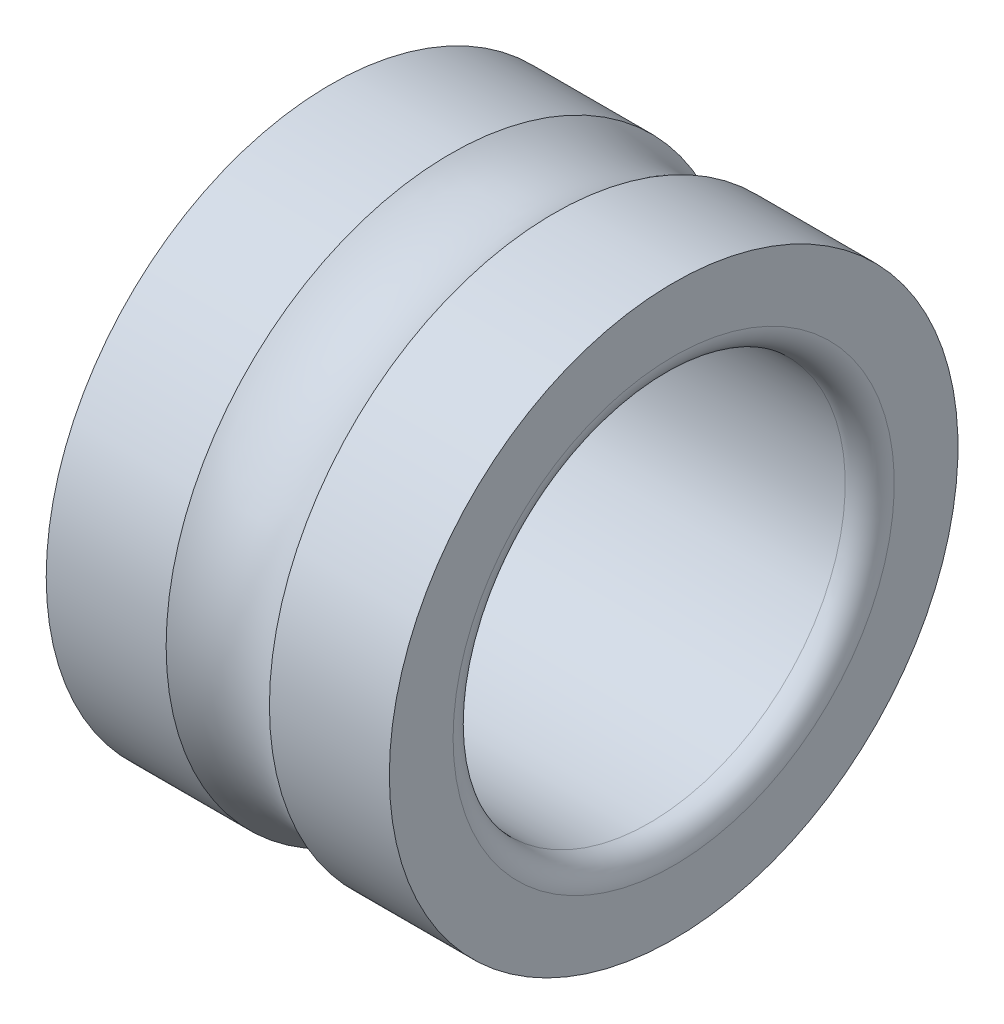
from build123d import *


with BuildPart() as part:
    # Esquisse1 → Base-R_volution (revolve)
    with BuildSketch(Plane.XY, mode=Mode.PRIVATE) as base_r_volution_sk:
        with BuildLine():
            Line((3.5, 4.5), (3.5, 5.8))
            Line((3.5, 5.8), (1.053565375, 5.8))
            ThreePointArc((1.053565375, 5.8), (0, 5.5), (-1.053565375, 5.8))
            Line((-1.053565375, 5.8), (-3.5, 5.8))
            Line((-3.5, 5.8), (-3.5, 4.5))
            ThreePointArc((-3.5, 4.5), (-3.353553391, 4.146446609), (-3, 4))
            Line((-3, 4), (3, 4))
            ThreePointArc((3, 4), (3.353553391, 4.146446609), (3.5, 4.5))
        make_face()
    revolve(base_r_volution_sk.sketch.rotate(Axis((-4.370908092, 0, 0), (1, 0, 0)), 90), axis=Axis((-4.370908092, 0, 0), (1, 0, 0)))


solid = part.part
